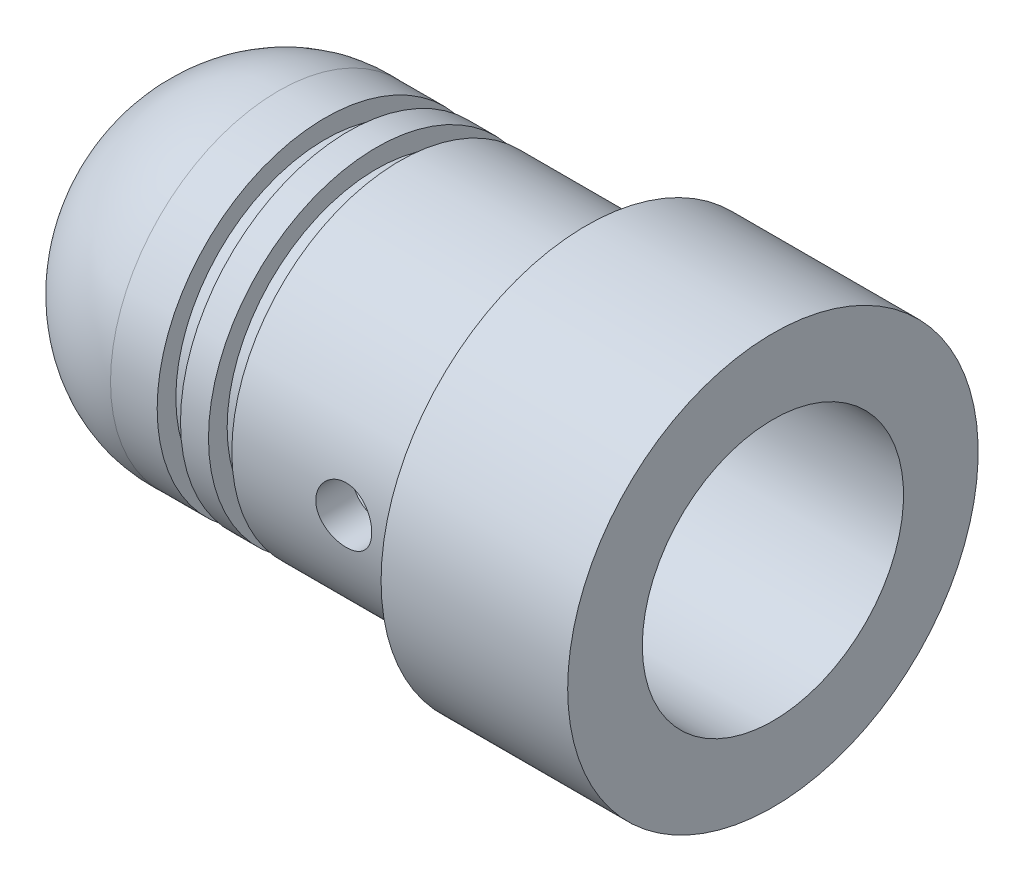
ISO-10303-21;
HEADER;
FILE_DESCRIPTION(('STEP AP214'),'2;1');
FILE_NAME('part.step','',(''),(''),'','','');
FILE_SCHEMA(('AUTOMOTIVE_DESIGN { 1 0 10303 214 1 1 1 1 }'));
ENDSEC;
DATA;
#1=APPLICATION_CONTEXT('core data for automotive mechanical design processes');
#2=APPLICATION_PROTOCOL_DEFINITION('international standard','automotive_design',2000,#1);
#3=PRODUCT_CONTEXT('',#1,'mechanical');
#4=PRODUCT('Part','Part','',(#3));
#5=PRODUCT_RELATED_PRODUCT_CATEGORY('part','',(#4));
#6=PRODUCT_DEFINITION_FORMATION('','',#4);
#7=PRODUCT_DEFINITION_CONTEXT('part definition',#1,'design');
#8=PRODUCT_DEFINITION('design','',#6,#7);
#9=PRODUCT_DEFINITION_SHAPE('','',#8);
#10=(LENGTH_UNIT() NAMED_UNIT(*) SI_UNIT(.MILLI.,.METRE.));
#11=(NAMED_UNIT(*) PLANE_ANGLE_UNIT() SI_UNIT($,.RADIAN.));
#12=(NAMED_UNIT(*) SI_UNIT($,.STERADIAN.) SOLID_ANGLE_UNIT());
#13=UNCERTAINTY_MEASURE_WITH_UNIT(LENGTH_MEASURE(1.E-05),#10,'distance_accuracy_value','');
#14=(GEOMETRIC_REPRESENTATION_CONTEXT(3) GLOBAL_UNCERTAINTY_ASSIGNED_CONTEXT((#13)) GLOBAL_UNIT_ASSIGNED_CONTEXT((#10,
#11,#12)) REPRESENTATION_CONTEXT('',''));
#15=CARTESIAN_POINT('',(0.,0.,0.));
#16=DIRECTION('',(0.,0.,1.));
#17=DIRECTION('',(1.,0.,0.));
#18=AXIS2_PLACEMENT_3D('',#15,#16,#17);
#19=CARTESIAN_POINT('',(-16.9151749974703,14.0000000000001,0.));
#20=DIRECTION('',(0.,0.,1.));
#21=DIRECTION('',(0.0554700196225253,0.998460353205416,0.));
#22=AXIS2_PLACEMENT_3D('',#19,#20,#21);
#23=ELLIPSE('',#22,9.01387818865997,7.99738020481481);
#24=TRIMMED_CURVE('',#23,(PARAMETER_VALUE(-1.52154564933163)),
(PARAMETER_VALUE(1.62004700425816)),.T.,.PARAMETER.);
#25=CARTESIAN_POINT('',(-99.9876483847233,14.,0.));
#26=DIRECTION('',(-1.,0.,0.));
#27=AXIS1_PLACEMENT('',#25,#26);
#28=SURFACE_OF_REVOLUTION('',#24,#27);
#29=CARTESIAN_POINT('',(-24.9151749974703,14.,0.));
#30=VERTEX_POINT('',#29);
#31=VERTEX_LOOP('',#30);
#32=FACE_BOUND('',#31,.T.);
#33=CARTESIAN_POINT('',(-16.4151749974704,14.0000000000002,0.));
#34=DIRECTION('',(-1.,0.,0.));
#35=DIRECTION('',(0.,0.,1.));
#36=AXIS2_PLACEMENT_3D('',#33,#34,#35);
#37=CIRCLE('',#36,9.);
#38=CARTESIAN_POINT('',(-16.4151749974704,14.0000000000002,9.));
#39=VERTEX_POINT('',#38);
#40=EDGE_CURVE('E373',#39,#39,#37,.T.);
#41=ORIENTED_EDGE('',*,*,#40,.T.);
#42=EDGE_LOOP('',(#41));
#43=FACE_BOUND('',#42,.T.);
#44=ADVANCED_FACE('F352',(#32,#43),#28,.T.);
#45=CARTESIAN_POINT('',(-14.9151749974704,21.,0.));
#46=DIRECTION('',(-1.,0.,0.));
#47=DIRECTION('',(0.,0.,1.));
#48=AXIS2_PLACEMENT_3D('',#45,#46,#47);
#49=PLANE('',#48);
#50=CARTESIAN_POINT('',(-14.9151749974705,14.0000000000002,0.));
#51=DIRECTION('',(-1.,0.,0.));
#52=DIRECTION('',(0.,0.,1.));
#53=AXIS2_PLACEMENT_3D('',#50,#51,#52);
#54=CIRCLE('',#53,7.);
#55=CARTESIAN_POINT('',(-14.9151749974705,14.0000000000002,7.));
#56=VERTEX_POINT('',#55);
#57=EDGE_CURVE('E11',#56,#56,#54,.T.);
#58=ORIENTED_EDGE('',*,*,#57,.F.);
#59=EDGE_LOOP('',(#58));
#60=FACE_BOUND('',#59,.T.);
#61=ADVANCED_FACE('F370',(#60),#49,.F.);
#62=CARTESIAN_POINT('',(-99.9876483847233,14.,0.));
#63=DIRECTION('',(-1.,0.,0.));
#64=DIRECTION('',(0.,0.,1.));
#65=AXIS2_PLACEMENT_3D('',#62,#63,#64);
#66=CYLINDRICAL_SURFACE('',#65,7.);
#67=CARTESIAN_POINT('',(-2.41517499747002,14.0000000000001,7.00000000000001));
#68=CARTESIAN_POINT('',(-2.4151778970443,14.0832358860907,6.99999846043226));
#69=CARTESIAN_POINT('',(-2.42212660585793,14.1665071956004,6.99850025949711));
#70=CARTESIAN_POINT('',(-2.44971065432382,14.3306873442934,6.99266829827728));
#71=CARTESIAN_POINT('',(-2.47035604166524,14.4115944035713,6.98833245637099));
#72=CARTESIAN_POINT('',(-2.52465936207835,14.5686493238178,6.97730831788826));
#73=CARTESIAN_POINT('',(-2.55830397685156,14.6448019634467,6.97062242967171));
#74=CARTESIAN_POINT('',(-2.63760908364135,14.7903781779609,6.9556210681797));
#75=CARTESIAN_POINT('',(-2.68326916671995,14.8598019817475,6.9473056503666));
#76=CARTESIAN_POINT('',(-2.78605529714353,14.9910247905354,6.92981369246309));
#77=CARTESIAN_POINT('',(-2.84333121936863,15.0527050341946,6.92062683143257));
#78=CARTESIAN_POINT('',(-2.96740131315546,15.1656604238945,6.90250069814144));
#79=CARTESIAN_POINT('',(-3.03419630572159,15.2169346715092,6.89356144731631));
#80=CARTESIAN_POINT('',(-3.17628075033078,15.3081420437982,6.87684116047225));
#81=CARTESIAN_POINT('',(-3.25165251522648,15.3479495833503,6.86907336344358));
#82=CARTESIAN_POINT('',(-3.40820945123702,15.4142882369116,6.85572325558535));
#83=CARTESIAN_POINT('',(-3.48939395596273,15.4408208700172,6.85014069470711));
#84=CARTESIAN_POINT('',(-3.65398608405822,15.4794657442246,6.84189808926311));
#85=CARTESIAN_POINT('',(-3.73734227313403,15.4917877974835,6.83919556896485));
#86=CARTESIAN_POINT('',(-3.90497922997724,15.5023139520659,6.83689139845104));
#87=CARTESIAN_POINT('',(-3.98925988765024,15.5005197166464,6.83728938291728));
#88=CARTESIAN_POINT('',(-4.15479968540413,15.4830332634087,6.84110276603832));
#89=CARTESIAN_POINT('',(-4.23608588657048,15.4675839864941,6.84446541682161));
#90=CARTESIAN_POINT('',(-4.39488523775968,15.4236105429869,6.85374593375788));
#91=CARTESIAN_POINT('',(-4.47239818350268,15.3950856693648,6.85966393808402));
#92=CARTESIAN_POINT('',(-4.62213787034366,15.32554551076,6.87344080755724));
#93=CARTESIAN_POINT('',(-4.69431951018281,15.2844361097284,6.88131420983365));
#94=CARTESIAN_POINT('',(-4.83085016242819,15.19096007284,6.89810572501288));
#95=CARTESIAN_POINT('',(-4.89519814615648,15.1385919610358,6.90702397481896));
#96=CARTESIAN_POINT('',(-5.01563435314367,15.0227954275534,6.92512718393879));
#97=CARTESIAN_POINT('',(-5.07152370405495,14.9591602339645,6.93431383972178));
#98=CARTESIAN_POINT('',(-5.17186873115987,14.8233173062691,6.95175017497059));
#99=CARTESIAN_POINT('',(-5.21632421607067,14.7511094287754,6.9599998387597));
#100=CARTESIAN_POINT('',(-5.2925856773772,14.59993346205,6.97465778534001));
#101=CARTESIAN_POINT('',(-5.32436641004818,14.5209522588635,6.98106238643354));
#102=CARTESIAN_POINT('',(-5.37415064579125,14.3586031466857,6.99128109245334));
#103=CARTESIAN_POINT('',(-5.39215607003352,14.2752358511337,6.99509555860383));
#104=CARTESIAN_POINT('',(-5.41359121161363,14.1081876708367,6.99965306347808));
#105=CARTESIAN_POINT('',(-5.41729271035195,14.0245431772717,7.00045336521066));
#106=CARTESIAN_POINT('',(-5.41075042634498,13.8578310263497,6.9990524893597));
#107=CARTESIAN_POINT('',(-5.40050754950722,13.7747633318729,6.99685150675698));
#108=CARTESIAN_POINT('',(-5.36659275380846,13.6124574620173,6.98973143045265));
#109=CARTESIAN_POINT('',(-5.34306262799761,13.5331882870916,6.9848410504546));
#110=CARTESIAN_POINT('',(-5.28339805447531,13.3797215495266,6.97288924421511));
#111=CARTESIAN_POINT('',(-5.24726256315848,13.3055244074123,6.96582763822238));
#112=CARTESIAN_POINT('',(-5.1628414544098,13.1631786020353,6.95017504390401));
#113=CARTESIAN_POINT('',(-5.11439520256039,13.0951274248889,6.94156431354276));
#114=CARTESIAN_POINT('',(-5.0069401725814,12.9680230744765,6.92381033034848));
#115=CARTESIAN_POINT('',(-4.94793008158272,12.9089710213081,6.91466701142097));
#116=CARTESIAN_POINT('',(-4.81977762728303,12.8004728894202,6.89668172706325));
#117=CARTESIAN_POINT('',(-4.75047489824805,12.7512146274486,6.88784792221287));
#118=CARTESIAN_POINT('',(-4.6044204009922,12.6650358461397,6.87166654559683));
#119=CARTESIAN_POINT('',(-4.52766895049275,12.628114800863,6.86431891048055));
#120=CARTESIAN_POINT('',(-4.36930269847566,12.5679025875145,6.85201009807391));
#121=CARTESIAN_POINT('',(-4.28771764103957,12.5445360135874,6.84703574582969));
#122=CARTESIAN_POINT('',(-4.12165941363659,12.5118730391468,6.8400118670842));
#123=CARTESIAN_POINT('',(-4.03718668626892,12.5025744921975,6.83796189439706));
#124=CARTESIAN_POINT('',(-3.869642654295,12.4984000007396,6.83704618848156));
#125=CARTESIAN_POINT('',(-3.78657898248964,12.503226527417,6.83811476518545));
#126=CARTESIAN_POINT('',(-3.62247775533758,12.5265021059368,6.84316763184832));
#127=CARTESIAN_POINT('',(-3.54144017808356,12.5449510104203,6.84715189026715));
#128=CARTESIAN_POINT('',(-3.38391633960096,12.5948065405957,6.85755581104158));
#129=CARTESIAN_POINT('',(-3.30741634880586,12.6261715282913,6.86396764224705));
#130=CARTESIAN_POINT('',(-3.16071962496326,12.7009324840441,6.87850764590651));
#131=CARTESIAN_POINT('',(-3.09052351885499,12.744329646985,6.88663598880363));
#132=CARTESIAN_POINT('',(-2.95695680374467,12.842917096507,6.90389055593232));
#133=CARTESIAN_POINT('',(-2.89374530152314,12.8983201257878,6.91303309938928));
#134=CARTESIAN_POINT('',(-2.77741873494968,13.0189134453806,6.93117449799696));
#135=CARTESIAN_POINT('',(-2.72430600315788,13.0841059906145,6.94017331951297));
#136=CARTESIAN_POINT('',(-2.62905903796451,13.2233968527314,6.95714491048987));
#137=CARTESIAN_POINT('',(-2.58706839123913,13.2975951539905,6.96510364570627));
#138=CARTESIAN_POINT('',(-2.51622046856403,13.4521498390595,6.97895826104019));
#139=CARTESIAN_POINT('',(-2.48735197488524,13.5325008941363,6.98485590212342));
#140=CARTESIAN_POINT('',(-2.44882281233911,13.6774647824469,6.99284848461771));
#141=CARTESIAN_POINT('',(-2.43622856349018,13.7412827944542,6.99551391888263));
#142=CARTESIAN_POINT('',(-2.41940369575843,13.8700600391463,6.9990902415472));
#143=CARTESIAN_POINT('',(-2.41517273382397,13.9350192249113,7.00000120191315));
#144=CARTESIAN_POINT('',(-2.41517499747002,14.0000000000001,7.00000000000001));
#145=B_SPLINE_CURVE_WITH_KNOTS('',3,(#67,#68,#69,#70,#71,#72,#73,#74,#75,#76,#77,#78,#79,#80,
#81,#82,#83,#84,#85,#86,#87,#88,#89,#90,#91,#92,#93,#94,#95,#96,#97,#98,#99,#100,#101,#102,#103,
#104,#105,#106,#107,#108,#109,#110,#111,#112,#113,#114,#115,#116,#117,#118,#119,#120,#121,#122,
#123,#124,#125,#126,#127,#128,#129,#130,#131,#132,#133,#134,#135,#136,#137,#138,#139,#140,#141,
#142,#143,#144),.UNSPECIFIED.,.T.,.F.,(4,2,2,2,2,2,2,2,2,2,2,2,2,2,2,2,2,2,2,2,2,2,2,2,2,2,2,2,
2,2,2,2,2,2,2,2,2,2,4),(0.,0.249469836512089,0.499122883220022,0.748520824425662,
0.997910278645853,1.25074961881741,1.50361077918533,1.75914429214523,2.01464855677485,
2.26633008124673,2.51798195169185,2.76524475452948,3.01252092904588,3.26169356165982,
3.51089887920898,3.76527011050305,4.01964559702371,4.27452521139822,4.52936927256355,
4.77934665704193,5.02930780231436,5.27665060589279,5.52401389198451,5.77478733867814,
6.02559197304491,6.2808206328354,6.53603841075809,6.78982240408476,7.04356767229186,
7.29200680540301,7.54044325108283,7.788084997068,8.03575134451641,8.28822950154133,
8.54076590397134,8.79641910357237,9.05185334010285,9.24661799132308,9.44137465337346),.UNSPECIFIED.);
#146=CARTESIAN_POINT('',(-2.41517499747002,14.0000000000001,7.00000000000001));
#147=VERTEX_POINT('',#146);
#148=EDGE_CURVE('E376',#147,#147,#145,.T.);
#149=ORIENTED_EDGE('',*,*,#148,.T.);
#150=EDGE_LOOP('',(#149));
#151=FACE_BOUND('',#150,.T.);
#152=CARTESIAN_POINT('',(-2.41517499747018,14.0000000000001,-7.));
#153=CARTESIAN_POINT('',(-2.41517789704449,13.9167641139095,-6.99999846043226));
#154=CARTESIAN_POINT('',(-2.42212660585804,13.8334928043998,-6.9985002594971));
#155=CARTESIAN_POINT('',(-2.44971065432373,13.6693126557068,-6.99266829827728));
#156=CARTESIAN_POINT('',(-2.47035604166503,13.5884055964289,-6.988332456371));
#157=CARTESIAN_POINT('',(-2.52465936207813,13.4313506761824,-6.97730831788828));
#158=CARTESIAN_POINT('',(-2.55830397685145,13.3551980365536,-6.97062242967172));
#159=CARTESIAN_POINT('',(-2.63760908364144,13.2096218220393,-6.95562106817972));
#160=CARTESIAN_POINT('',(-2.68326916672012,13.1401980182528,-6.94730565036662));
#161=CARTESIAN_POINT('',(-2.78605529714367,13.0089752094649,-6.92981369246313));
#162=CARTESIAN_POINT('',(-2.84333121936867,12.9472949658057,-6.92062683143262));
#163=CARTESIAN_POINT('',(-2.96740131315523,12.8343395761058,-6.90250069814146));
#164=CARTESIAN_POINT('',(-3.0341963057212,12.7830653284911,-6.89356144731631));
#165=CARTESIAN_POINT('',(-3.17628075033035,12.691857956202,-6.87684116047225));
#166=CARTESIAN_POINT('',(-3.25165251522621,12.6520504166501,-6.86907336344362));
#167=CARTESIAN_POINT('',(-3.40820945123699,12.5857117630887,-6.85572325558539));
#168=CARTESIAN_POINT('',(-3.4893939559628,12.5591791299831,-6.85014069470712));
#169=CARTESIAN_POINT('',(-3.6539860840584,12.5205342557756,-6.84189808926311));
#170=CARTESIAN_POINT('',(-3.7373422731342,12.5082122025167,-6.83919556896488));
#171=CARTESIAN_POINT('',(-3.90497922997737,12.4976860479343,-6.83689139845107));
#172=CARTESIAN_POINT('',(-3.98925988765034,12.4994802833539,-6.83728938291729));
#173=CARTESIAN_POINT('',(-4.15479968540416,12.5169667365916,-6.84110276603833));
#174=CARTESIAN_POINT('',(-4.23608588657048,12.5324160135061,-6.84446541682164));
#175=CARTESIAN_POINT('',(-4.39488523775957,12.5763894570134,-6.8537459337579));
#176=CARTESIAN_POINT('',(-4.47239818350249,12.6049143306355,-6.85966393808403));
#177=CARTESIAN_POINT('',(-4.62213787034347,12.6744544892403,-6.87344080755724));
#178=CARTESIAN_POINT('',(-4.6943195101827,12.7155638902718,-6.88131420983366));
#179=CARTESIAN_POINT('',(-4.83085016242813,12.8090399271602,-6.8981057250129));
#180=CARTESIAN_POINT('',(-4.89519814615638,12.8614080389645,-6.90702397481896));
#181=CARTESIAN_POINT('',(-5.01563435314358,12.977204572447,-6.92512718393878));
#182=CARTESIAN_POINT('',(-5.07152370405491,13.0408397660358,-6.9343138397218));
#183=CARTESIAN_POINT('',(-5.17186873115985,13.1766826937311,-6.95175017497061));
#184=CARTESIAN_POINT('',(-5.2163242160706,13.2488905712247,-6.95999983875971));
#185=CARTESIAN_POINT('',(-5.29258567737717,13.4000665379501,-6.97465778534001));
#186=CARTESIAN_POINT('',(-5.32436641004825,13.4790477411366,-6.98106238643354));
#187=CARTESIAN_POINT('',(-5.37415064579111,13.6413968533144,-6.99128109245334));
#188=CARTESIAN_POINT('',(-5.39215607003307,13.7247641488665,-6.99509555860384));
#189=CARTESIAN_POINT('',(-5.41359121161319,13.8918123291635,-6.99965306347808));
#190=CARTESIAN_POINT('',(-5.41729271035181,13.9754568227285,-7.00045336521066));
#191=CARTESIAN_POINT('',(-5.41075042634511,14.1421689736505,-6.99905248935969));
#192=CARTESIAN_POINT('',(-5.40050754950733,14.2252366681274,-6.99685150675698));
#193=CARTESIAN_POINT('',(-5.36659275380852,14.3875425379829,-6.98973143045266));
#194=CARTESIAN_POINT('',(-5.34306262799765,14.4668117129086,-6.98484105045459));
#195=CARTESIAN_POINT('',(-5.28339805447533,14.6202784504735,-6.9728892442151));
#196=CARTESIAN_POINT('',(-5.24726256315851,14.6944755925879,-6.96582763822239));
#197=CARTESIAN_POINT('',(-5.16284145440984,14.8368213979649,-6.95017504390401));
#198=CARTESIAN_POINT('',(-5.11439520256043,14.9048725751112,-6.94156431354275));
#199=CARTESIAN_POINT('',(-5.00694017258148,15.0319769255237,-6.92381033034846));
#200=CARTESIAN_POINT('',(-4.94793008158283,15.0910289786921,-6.91466701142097));
#201=CARTESIAN_POINT('',(-4.81977762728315,15.19952711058,-6.89668172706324));
#202=CARTESIAN_POINT('',(-4.75047489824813,15.2487853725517,-6.88784792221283));
#203=CARTESIAN_POINT('',(-4.60442040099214,15.3349641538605,-6.87166654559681));
#204=CARTESIAN_POINT('',(-4.52766895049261,15.3718851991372,-6.86431891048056));
#205=CARTESIAN_POINT('',(-4.36930269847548,15.4320974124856,-6.85201009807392));
#206=CARTESIAN_POINT('',(-4.28771764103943,15.4554639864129,-6.84703574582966));
#207=CARTESIAN_POINT('',(-4.12165941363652,15.4881269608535,-6.84001186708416));
#208=CARTESIAN_POINT('',(-4.03718668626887,15.4974255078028,-6.83796189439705));
#209=CARTESIAN_POINT('',(-3.869642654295,15.5015999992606,-6.83704618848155));
#210=CARTESIAN_POINT('',(-3.78657898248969,15.4967734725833,-6.83811476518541));
#211=CARTESIAN_POINT('',(-3.62247775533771,15.4734978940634,-6.84316763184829));
#212=CARTESIAN_POINT('',(-3.54144017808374,15.4550489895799,-6.84715189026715));
#213=CARTESIAN_POINT('',(-3.38391633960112,15.4051934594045,-6.85755581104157));
#214=CARTESIAN_POINT('',(-3.30741634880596,15.373828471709,-6.86396764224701));
#215=CARTESIAN_POINT('',(-3.16071962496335,15.2990675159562,-6.87850764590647));
#216=CARTESIAN_POINT('',(-3.09052351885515,15.2556703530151,-6.88663598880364));
#217=CARTESIAN_POINT('',(-2.95695680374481,15.1570829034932,-6.90389055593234));
#218=CARTESIAN_POINT('',(-2.89374530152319,15.1016798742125,-6.91303309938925));
#219=CARTESIAN_POINT('',(-2.77741873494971,14.9810865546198,-6.93117449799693));
#220=CARTESIAN_POINT('',(-2.72430600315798,14.9158940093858,-6.94017331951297));
#221=CARTESIAN_POINT('',(-2.62905903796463,14.7766031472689,-6.95714491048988));
#222=CARTESIAN_POINT('',(-2.58706839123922,14.7024048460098,-6.96510364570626));
#223=CARTESIAN_POINT('',(-2.51622046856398,14.5478501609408,-6.97895826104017));
#224=CARTESIAN_POINT('',(-2.48735197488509,14.4674991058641,-6.98485590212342));
#225=CARTESIAN_POINT('',(-2.44882281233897,14.3225352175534,-6.99284848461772));
#226=CARTESIAN_POINT('',(-2.43622856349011,14.2587172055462,-6.99551391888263));
#227=CARTESIAN_POINT('',(-2.41940369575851,14.129939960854,-6.99909024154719));
#228=CARTESIAN_POINT('',(-2.41517273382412,14.0649807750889,-7.00000120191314));
#229=CARTESIAN_POINT('',(-2.41517499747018,14.0000000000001,-7.));
#230=B_SPLINE_CURVE_WITH_KNOTS('',3,(#152,#153,#154,#155,#156,#157,#158,#159,#160,#161,#162,
#163,#164,#165,#166,#167,#168,#169,#170,#171,#172,#173,#174,#175,#176,#177,#178,#179,#180,#181,
#182,#183,#184,#185,#186,#187,#188,#189,#190,#191,#192,#193,#194,#195,#196,#197,#198,#199,#200,
#201,#202,#203,#204,#205,#206,#207,#208,#209,#210,#211,#212,#213,#214,#215,#216,#217,#218,#219,
#220,#221,#222,#223,#224,#225,#226,#227,#228,#229),.UNSPECIFIED.,.T.,.F.,(4,2,2,2,2,2,2,2,2,2,2,
2,2,2,2,2,2,2,2,2,2,2,2,2,2,2,2,2,2,2,2,2,2,2,2,2,2,2,4),(0.,0.249469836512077,0.4991228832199,
0.748520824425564,0.997910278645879,1.25074961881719,1.50361077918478,1.75914429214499,
2.01464855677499,2.26633008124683,2.51798195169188,2.76524475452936,3.01252092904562,
3.26169356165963,3.51089887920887,3.76527011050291,4.01964559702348,4.27452521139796,
4.52936927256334,4.77934665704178,5.02930780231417,5.27665060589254,5.52401389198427,
5.7747873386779,6.02559197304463,6.28082063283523,6.53603841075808,6.7898224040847,
7.04356767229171,7.29200680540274,7.54044325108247,7.78808499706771,8.03575134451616,
8.28822950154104,8.54076590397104,8.7964191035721,9.05185334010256,9.24661799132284,
9.44137465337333),.UNSPECIFIED.);
#231=CARTESIAN_POINT('',(-2.41517499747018,14.0000000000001,-7.));
#232=VERTEX_POINT('',#231);
#233=EDGE_CURVE('E382',#232,#232,#230,.T.);
#234=ORIENTED_EDGE('',*,*,#233,.T.);
#235=EDGE_LOOP('',(#234));
#236=FACE_BOUND('',#235,.T.);
#237=CARTESIAN_POINT('',(10.0848250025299,14.0000000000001,0.));
#238=DIRECTION('',(-1.,0.,0.));
#239=DIRECTION('',(0.,0.,1.));
#240=AXIS2_PLACEMENT_3D('',#237,#238,#239);
#241=CIRCLE('',#240,7.);
#242=CARTESIAN_POINT('',(10.0848250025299,14.0000000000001,7.00000000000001));
#243=VERTEX_POINT('',#242);
#244=EDGE_CURVE('E364',#243,#243,#241,.T.);
#245=ORIENTED_EDGE('',*,*,#244,.F.);
#246=EDGE_LOOP('',(#245));
#247=FACE_BOUND('',#246,.T.);
#248=ORIENTED_EDGE('',*,*,#57,.T.);
#249=EDGE_LOOP('',(#248));
#250=FACE_BOUND('',#249,.T.);
#251=ADVANCED_FACE('F442',(#151,#236,#247,#250),#66,.F.);
#252=CARTESIAN_POINT('',(10.0848250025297,25.,0.));
#253=DIRECTION('',(-1.,0.,0.));
#254=DIRECTION('',(0.,0.,1.));
#255=AXIS2_PLACEMENT_3D('',#252,#253,#254);
#256=PLANE('',#255);
#257=CARTESIAN_POINT('',(10.0848250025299,14.0000000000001,0.));
#258=DIRECTION('',(-1.,0.,0.));
#259=DIRECTION('',(0.,0.,1.));
#260=AXIS2_PLACEMENT_3D('',#257,#258,#259);
#261=CIRCLE('',#260,11.);
#262=CARTESIAN_POINT('',(10.0848250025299,14.0000000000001,11.));
#263=VERTEX_POINT('',#262);
#264=EDGE_CURVE('E412',#263,#263,#261,.T.);
#265=ORIENTED_EDGE('',*,*,#264,.F.);
#266=EDGE_LOOP('',(#265));
#267=FACE_BOUND('',#266,.T.);
#268=ORIENTED_EDGE('',*,*,#244,.T.);
#269=EDGE_LOOP('',(#268));
#270=FACE_BOUND('',#269,.T.);
#271=ADVANCED_FACE('F446',(#267,#270),#256,.F.);
#272=CARTESIAN_POINT('',(-99.9876483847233,14.,0.));
#273=DIRECTION('',(-1.,0.,0.));
#274=DIRECTION('',(0.,0.,1.));
#275=AXIS2_PLACEMENT_3D('',#272,#273,#274);
#276=CYLINDRICAL_SURFACE('',#275,11.);
#277=CARTESIAN_POINT('',(0.0848250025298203,14.0000000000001,0.));
#278=DIRECTION('',(-1.,0.,0.));
#279=DIRECTION('',(0.,0.,1.));
#280=AXIS2_PLACEMENT_3D('',#277,#278,#279);
#281=CIRCLE('',#280,11.);
#282=CARTESIAN_POINT('',(0.0848250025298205,14.0000000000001,11.));
#283=VERTEX_POINT('',#282);
#284=EDGE_CURVE('E409',#283,#283,#281,.T.);
#285=ORIENTED_EDGE('',*,*,#284,.F.);
#286=EDGE_LOOP('',(#285));
#287=FACE_BOUND('',#286,.T.);
#288=ORIENTED_EDGE('',*,*,#264,.T.);
#289=EDGE_LOOP('',(#288));
#290=FACE_BOUND('',#289,.T.);
#291=ADVANCED_FACE('F469',(#287,#290),#276,.T.);
#292=CARTESIAN_POINT('',(0.084825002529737,23.0000000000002,0.));
#293=DIRECTION('',(1.,0.,0.));
#294=DIRECTION('',(0.,0.,-1.));
#295=AXIS2_PLACEMENT_3D('',#292,#293,#294);
#296=PLANE('',#295);
#297=CARTESIAN_POINT('',(0.0848250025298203,14.0000000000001,0.));
#298=DIRECTION('',(-1.,0.,0.));
#299=DIRECTION('',(0.,0.,1.));
#300=AXIS2_PLACEMENT_3D('',#297,#298,#299);
#301=CIRCLE('',#300,9.);
#302=CARTESIAN_POINT('',(0.0848250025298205,14.0000000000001,9.));
#303=VERTEX_POINT('',#302);
#304=EDGE_CURVE('E406',#303,#303,#301,.T.);
#305=ORIENTED_EDGE('',*,*,#304,.F.);
#306=EDGE_LOOP('',(#305));
#307=FACE_BOUND('',#306,.T.);
#308=ORIENTED_EDGE('',*,*,#284,.T.);
#309=EDGE_LOOP('',(#308));
#310=FACE_BOUND('',#309,.T.);
#311=ADVANCED_FACE('F476',(#307,#310),#296,.F.);
#312=CARTESIAN_POINT('',(-99.9876483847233,14.,0.));
#313=DIRECTION('',(-1.,0.,0.));
#314=DIRECTION('',(0.,0.,1.));
#315=AXIS2_PLACEMENT_3D('',#312,#313,#314);
#316=CYLINDRICAL_SURFACE('',#315,9.);
#317=CARTESIAN_POINT('',(-2.41517499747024,14.0000000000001,8.99999999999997));
#318=CARTESIAN_POINT('',(-2.41517835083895,13.9163654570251,8.99999856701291));
#319=CARTESIAN_POINT('',(-2.42219336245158,13.8326852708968,8.9988220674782));
#320=CARTESIAN_POINT('',(-2.45005639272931,13.6676718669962,8.99424206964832));
#321=CARTESIAN_POINT('',(-2.470917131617,13.5863408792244,8.99083652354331));
#322=CARTESIAN_POINT('',(-2.52582426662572,13.4284371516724,8.98218040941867));
#323=CARTESIAN_POINT('',(-2.55985987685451,13.3518605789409,8.97693135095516));
#324=CARTESIAN_POINT('',(-2.64012237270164,13.2055148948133,8.96516536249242));
#325=CARTESIAN_POINT('',(-2.68634786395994,13.1357450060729,8.95864857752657));
#326=CARTESIAN_POINT('',(-2.79014804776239,13.0043164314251,8.94499990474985));
#327=CARTESIAN_POINT('',(-2.84781646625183,12.9427322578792,8.93786323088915));
#328=CARTESIAN_POINT('',(-2.97266377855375,12.8300669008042,8.92381576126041));
#329=CARTESIAN_POINT('',(-3.0398432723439,12.7789863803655,8.91690497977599));
#330=CARTESIAN_POINT('',(-3.18231757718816,12.688479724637,8.90404539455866));
#331=CARTESIAN_POINT('',(-3.25765979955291,12.6491272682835,8.89810277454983));
#332=CARTESIAN_POINT('',(-3.41400073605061,12.5836649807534,8.88791873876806));
#333=CARTESIAN_POINT('',(-3.49499906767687,12.5575542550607,8.88367720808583));
#334=CARTESIAN_POINT('',(-3.65956316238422,12.5195513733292,8.87742322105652));
#335=CARTESIAN_POINT('',(-3.74309843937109,12.5075305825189,8.87539061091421));
#336=CARTESIAN_POINT('',(-3.91102316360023,12.4976499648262,8.87372363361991));
#337=CARTESIAN_POINT('',(-3.99541254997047,12.4997891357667,8.87408909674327));
#338=CARTESIAN_POINT('',(-4.16173171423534,12.5180629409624,8.87715857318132));
#339=CARTESIAN_POINT('',(-4.24367787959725,12.5340530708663,8.87983843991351));
#340=CARTESIAN_POINT('',(-4.40370778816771,12.5793481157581,8.88719697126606));
#341=CARTESIAN_POINT('',(-4.48179139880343,12.6086534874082,8.89187570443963));
#342=CARTESIAN_POINT('',(-4.63231229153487,12.6798936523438,8.9027308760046));
#343=CARTESIAN_POINT('',(-4.704720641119,12.7218884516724,8.90891440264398));
#344=CARTESIAN_POINT('',(-4.84151763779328,12.8172727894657,8.92207751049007));
#345=CARTESIAN_POINT('',(-4.90590563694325,12.8706632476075,8.92905715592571));
#346=CARTESIAN_POINT('',(-5.02567064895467,12.9881106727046,8.94313216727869));
#347=CARTESIAN_POINT('',(-5.08092610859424,13.0522916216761,8.9502278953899));
#348=CARTESIAN_POINT('',(-5.17990165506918,13.1890788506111,8.96365560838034));
#349=CARTESIAN_POINT('',(-5.22362166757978,13.2616851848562,8.96998758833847));
#350=CARTESIAN_POINT('',(-5.29829633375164,13.4133764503,8.98118335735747));
#351=CARTESIAN_POINT('',(-5.32924024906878,13.4924667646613,8.98604591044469));
#352=CARTESIAN_POINT('',(-5.37737152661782,13.6548209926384,8.99374501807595));
#353=CARTESIAN_POINT('',(-5.3945600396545,13.7380845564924,8.99658174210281));
#354=CARTESIAN_POINT('',(-5.41452781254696,13.9053740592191,8.99988677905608));
#355=CARTESIAN_POINT('',(-5.4174739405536,13.9893795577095,9.0003825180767));
#356=CARTESIAN_POINT('',(-5.4093181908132,14.156683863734,8.99902484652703));
#357=CARTESIAN_POINT('',(-5.39821685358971,14.2399826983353,8.99717152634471));
#358=CARTESIAN_POINT('',(-5.36242008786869,14.4029937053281,8.99134096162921));
#359=CARTESIAN_POINT('',(-5.33780727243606,14.4827245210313,8.98737662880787));
#360=CARTESIAN_POINT('',(-5.27577428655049,14.6369281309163,8.97776678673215));
#361=CARTESIAN_POINT('',(-5.23835339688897,14.7114006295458,8.9721211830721));
#362=CARTESIAN_POINT('',(-5.15138432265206,14.8536984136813,8.95970709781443));
#363=CARTESIAN_POINT('',(-5.10173190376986,14.9214591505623,8.95292913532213));
#364=CARTESIAN_POINT('',(-4.99185260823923,15.0477461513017,8.93903080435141));
#365=CARTESIAN_POINT('',(-4.93162496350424,15.106271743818,8.93191041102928));
#366=CARTESIAN_POINT('',(-4.80155646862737,15.2130456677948,8.91804105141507));
#367=CARTESIAN_POINT('',(-4.73162249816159,15.2611812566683,8.91129669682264));
#368=CARTESIAN_POINT('',(-4.58456321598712,15.3450213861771,8.8990291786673));
#369=CARTESIAN_POINT('',(-4.50743813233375,15.380726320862,8.8935059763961));
#370=CARTESIAN_POINT('',(-4.34850115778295,15.438522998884,8.88434072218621));
#371=CARTESIAN_POINT('',(-4.26671014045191,15.4606708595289,8.88069092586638));
#372=CARTESIAN_POINT('',(-4.10050291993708,15.4909012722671,8.87566630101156));
#373=CARTESIAN_POINT('',(-4.01608694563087,15.4989850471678,8.87429127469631));
#374=CARTESIAN_POINT('',(-3.84815189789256,15.5008237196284,8.87398039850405));
#375=CARTESIAN_POINT('',(-3.76463477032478,15.4947560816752,8.87501433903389));
#376=CARTESIAN_POINT('',(-3.5998274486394,15.4688479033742,8.87933868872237));
#377=CARTESIAN_POINT('',(-3.51853724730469,15.4490074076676,8.88262909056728));
#378=CARTESIAN_POINT('',(-3.36055993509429,15.396184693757,8.89108413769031));
#379=CARTESIAN_POINT('',(-3.28386759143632,15.3632177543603,8.89624660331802));
#380=CARTESIAN_POINT('',(-3.13707359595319,15.2850962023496,8.90786621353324));
#381=CARTESIAN_POINT('',(-3.06697227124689,15.2399409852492,8.91432342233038));
#382=CARTESIAN_POINT('',(-2.93445364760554,15.1380913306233,8.92790072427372));
#383=CARTESIAN_POINT('',(-2.87213738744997,15.0812663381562,8.93502777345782));
#384=CARTESIAN_POINT('',(-2.75786403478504,14.9579654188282,8.94908623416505));
#385=CARTESIAN_POINT('',(-2.70590933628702,14.8914872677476,8.95601760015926));
#386=CARTESIAN_POINT('',(-2.61350603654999,14.7502215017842,8.96895917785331));
#387=CARTESIAN_POINT('',(-2.57313937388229,14.6753796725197,8.97496269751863));
#388=CARTESIAN_POINT('',(-2.50561330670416,14.5199078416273,8.98530700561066));
#389=CARTESIAN_POINT('',(-2.47844074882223,14.439283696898,8.98964944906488));
#390=CARTESIAN_POINT('',(-2.44397183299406,14.2986219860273,8.99523474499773));
#391=CARTESIAN_POINT('',(-2.43319031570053,14.2394352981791,8.99701216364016));
#392=CARTESIAN_POINT('',(-2.41879075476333,14.1201735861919,8.99939529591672));
#393=CARTESIAN_POINT('',(-2.41517258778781,14.0600985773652,9.00000102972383));
#394=CARTESIAN_POINT('',(-2.41517499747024,14.0000000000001,8.99999999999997));
#395=B_SPLINE_CURVE_WITH_KNOTS('',3,(#317,#318,#319,#320,#321,#322,#323,#324,#325,#326,#327,
#328,#329,#330,#331,#332,#333,#334,#335,#336,#337,#338,#339,#340,#341,#342,#343,#344,#345,#346,
#347,#348,#349,#350,#351,#352,#353,#354,#355,#356,#357,#358,#359,#360,#361,#362,#363,#364,#365,
#366,#367,#368,#369,#370,#371,#372,#373,#374,#375,#376,#377,#378,#379,#380,#381,#382,#383,#384,
#385,#386,#387,#388,#389,#390,#391,#392,#393,#394),.UNSPECIFIED.,.T.,.F.,(4,2,2,2,2,2,2,2,2,2,2,
2,2,2,2,2,2,2,2,2,2,2,2,2,2,2,2,2,2,2,2,2,2,2,2,2,2,2,4),(0.,0.250683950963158,
0.501598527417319,0.752308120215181,1.00298904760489,1.25581494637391,1.50865680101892,
1.76305512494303,2.01743626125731,2.2694764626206,2.5214988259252,2.77092313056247,
3.02035599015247,3.2709873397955,3.52163892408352,3.77539661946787,4.0291559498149,
4.28312813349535,4.53707906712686,4.78804730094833,5.03900587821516,5.28844684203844,
5.53790181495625,5.78956095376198,6.04123837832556,6.29552293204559,6.54979942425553,
6.80301613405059,7.05621082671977,7.30624745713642,7.55628327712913,7.80602890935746,
8.05578693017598,8.30850830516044,8.56128800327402,8.81581338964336,9.07008451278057,
9.25022548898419,9.43036336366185),.UNSPECIFIED.);
#396=CARTESIAN_POINT('',(-2.41517499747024,14.0000000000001,8.99999999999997));
#397=VERTEX_POINT('',#396);
#398=EDGE_CURVE('E356',#397,#397,#395,.T.);
#399=ORIENTED_EDGE('',*,*,#398,.T.);
#400=EDGE_LOOP('',(#399));
#401=FACE_BOUND('',#400,.T.);
#402=CARTESIAN_POINT('',(-2.41517499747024,14.0000000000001,-9.00000000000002));
#403=CARTESIAN_POINT('',(-2.41517835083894,14.0836345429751,-8.99999856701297));
#404=CARTESIAN_POINT('',(-2.42219336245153,14.1673147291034,-8.9988220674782));
#405=CARTESIAN_POINT('',(-2.45005639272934,14.332328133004,-8.99424206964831));
#406=CARTESIAN_POINT('',(-2.47091713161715,14.4136591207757,-8.99083652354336));
#407=CARTESIAN_POINT('',(-2.52582426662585,14.5715628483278,-8.98218040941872));
#408=CARTESIAN_POINT('',(-2.55985987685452,14.6481394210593,-8.97693135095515));
#409=CARTESIAN_POINT('',(-2.64012237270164,14.794485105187,-8.9651653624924));
#410=CARTESIAN_POINT('',(-2.68634786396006,14.8642549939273,-8.9586485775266));
#411=CARTESIAN_POINT('',(-2.79014804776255,14.9956835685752,-8.94499990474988));
#412=CARTESIAN_POINT('',(-2.84781646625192,15.0572677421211,-8.93786323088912));
#413=CARTESIAN_POINT('',(-2.97266377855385,15.1699330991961,-8.92381576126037));
#414=CARTESIAN_POINT('',(-3.03984327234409,15.2210136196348,-8.916904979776));
#415=CARTESIAN_POINT('',(-3.18231757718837,15.3115202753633,-8.90404539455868));
#416=CARTESIAN_POINT('',(-3.25765979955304,15.3508727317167,-8.8981027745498));
#417=CARTESIAN_POINT('',(-3.41400073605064,15.4163350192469,-8.88791873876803));
#418=CARTESIAN_POINT('',(-3.49499906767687,15.4424457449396,-8.88367720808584));
#419=CARTESIAN_POINT('',(-3.65956316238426,15.4804486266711,-8.87742322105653));
#420=CARTESIAN_POINT('',(-3.74309843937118,15.4924694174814,-8.87539061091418));
#421=CARTESIAN_POINT('',(-3.91102316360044,15.5023500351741,-8.87372363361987));
#422=CARTESIAN_POINT('',(-3.99541254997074,15.5002108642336,-8.87408909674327));
#423=CARTESIAN_POINT('',(-4.16173171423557,15.4819370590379,-8.87715857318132));
#424=CARTESIAN_POINT('',(-4.24367787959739,15.465946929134,-8.87983843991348));
#425=CARTESIAN_POINT('',(-4.40370778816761,15.4206518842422,-8.88719697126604));
#426=CARTESIAN_POINT('',(-4.4817913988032,15.3913465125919,-8.89187570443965));
#427=CARTESIAN_POINT('',(-4.63231229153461,15.3201063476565,-8.90273087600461));
#428=CARTESIAN_POINT('',(-4.70472064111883,15.278111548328,-8.90891440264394));
#429=CARTESIAN_POINT('',(-4.8415176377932,15.1827272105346,-8.92207751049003));
#430=CARTESIAN_POINT('',(-4.90590563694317,15.1293367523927,-8.92905715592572));
#431=CARTESIAN_POINT('',(-5.02567064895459,15.0118893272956,-8.94313216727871));
#432=CARTESIAN_POINT('',(-5.08092610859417,14.947708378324,-8.95022789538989));
#433=CARTESIAN_POINT('',(-5.1799016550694,14.8109211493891,-8.96365560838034));
#434=CARTESIAN_POINT('',(-5.22362166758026,14.7383148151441,-8.9699875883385));
#435=CARTESIAN_POINT('',(-5.29829633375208,14.5866235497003,-8.9811833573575));
#436=CARTESIAN_POINT('',(-5.32924024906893,14.507533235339,-8.98604591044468));
#437=CARTESIAN_POINT('',(-5.37737152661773,14.3451790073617,-8.99374501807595));
#438=CARTESIAN_POINT('',(-5.39456003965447,14.2619154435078,-8.99658174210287));
#439=CARTESIAN_POINT('',(-5.41452781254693,14.094625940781,-8.99988677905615));
#440=CARTESIAN_POINT('',(-5.41747394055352,14.0106204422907,-9.00038251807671));
#441=CARTESIAN_POINT('',(-5.40931819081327,13.8433161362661,-8.99902484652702));
#442=CARTESIAN_POINT('',(-5.39821685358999,13.7600173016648,-8.99717152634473));
#443=CARTESIAN_POINT('',(-5.36242008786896,13.597006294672,-8.99134096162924));
#444=CARTESIAN_POINT('',(-5.3378072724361,13.5172754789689,-8.98737662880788));
#445=CARTESIAN_POINT('',(-5.27577428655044,13.3630718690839,-8.97776678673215));
#446=CARTESIAN_POINT('',(-5.23835339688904,13.2885993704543,-8.97212118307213));
#447=CARTESIAN_POINT('',(-5.15138432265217,13.1463015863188,-8.95970709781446));
#448=CARTESIAN_POINT('',(-5.10173190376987,13.0785408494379,-8.95292913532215));
#449=CARTESIAN_POINT('',(-4.99185260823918,12.9522538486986,-8.93903080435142));
#450=CARTESIAN_POINT('',(-4.93162496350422,12.8937282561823,-8.93191041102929));
#451=CARTESIAN_POINT('',(-4.80155646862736,12.7869543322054,-8.91804105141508));
#452=CARTESIAN_POINT('',(-4.73162249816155,12.7388187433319,-8.91129669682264));
#453=CARTESIAN_POINT('',(-4.58456321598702,12.6549786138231,-8.89902917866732));
#454=CARTESIAN_POINT('',(-4.5074381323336,12.6192736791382,-8.89350597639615));
#455=CARTESIAN_POINT('',(-4.34850115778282,12.5614770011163,-8.88434072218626));
#456=CARTESIAN_POINT('',(-4.26671014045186,12.5393291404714,-8.8806909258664));
#457=CARTESIAN_POINT('',(-4.10050291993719,12.5090987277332,-8.87566630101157));
#458=CARTESIAN_POINT('',(-4.01608694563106,12.5010149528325,-8.87429127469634));
#459=CARTESIAN_POINT('',(-3.84815189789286,12.4991762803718,-8.87398039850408));
#460=CARTESIAN_POINT('',(-3.7646347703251,12.505243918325,-8.87501433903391));
#461=CARTESIAN_POINT('',(-3.59982744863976,12.531152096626,-8.87933868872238));
#462=CARTESIAN_POINT('',(-3.51853724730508,12.5509925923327,-8.8826290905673));
#463=CARTESIAN_POINT('',(-3.36055993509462,12.6038153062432,-8.89108413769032));
#464=CARTESIAN_POINT('',(-3.28386759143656,12.6367822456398,-8.89624660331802));
#465=CARTESIAN_POINT('',(-3.13707359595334,12.7149037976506,-8.90786621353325));
#466=CARTESIAN_POINT('',(-3.06697227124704,12.760059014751,-8.91432342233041));
#467=CARTESIAN_POINT('',(-2.93445364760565,12.8619086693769,-8.92790072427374));
#468=CARTESIAN_POINT('',(-2.87213738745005,12.9187336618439,-8.93502777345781));
#469=CARTESIAN_POINT('',(-2.75786403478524,13.0420345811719,-8.94908623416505));
#470=CARTESIAN_POINT('',(-2.70590933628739,13.1085127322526,-8.95601760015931));
#471=CARTESIAN_POINT('',(-2.61350603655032,13.2497784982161,-8.96895917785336));
#472=CARTESIAN_POINT('',(-2.57313937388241,13.3246203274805,-8.97496269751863));
#473=CARTESIAN_POINT('',(-2.50561330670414,13.4800921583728,-8.98530700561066));
#474=CARTESIAN_POINT('',(-2.47844074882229,13.5607163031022,-8.98964944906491));
#475=CARTESIAN_POINT('',(-2.44397183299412,13.7013780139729,-8.99523474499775));
#476=CARTESIAN_POINT('',(-2.43319031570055,13.7605647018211,-8.99701216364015));
#477=CARTESIAN_POINT('',(-2.41879075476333,13.8798264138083,-8.99939529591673));
#478=CARTESIAN_POINT('',(-2.41517258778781,13.939901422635,-9.00000102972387));
#479=CARTESIAN_POINT('',(-2.41517499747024,14.0000000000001,-9.00000000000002));
#480=B_SPLINE_CURVE_WITH_KNOTS('',3,(#402,#403,#404,#405,#406,#407,#408,#409,#410,#411,#412,
#413,#414,#415,#416,#417,#418,#419,#420,#421,#422,#423,#424,#425,#426,#427,#428,#429,#430,#431,
#432,#433,#434,#435,#436,#437,#438,#439,#440,#441,#442,#443,#444,#445,#446,#447,#448,#449,#450,
#451,#452,#453,#454,#455,#456,#457,#458,#459,#460,#461,#462,#463,#464,#465,#466,#467,#468,#469,
#470,#471,#472,#473,#474,#475,#476,#477,#478,#479),.UNSPECIFIED.,.T.,.F.,(4,2,2,2,2,2,2,2,2,2,2,
2,2,2,2,2,2,2,2,2,2,2,2,2,2,2,2,2,2,2,2,2,2,2,2,2,2,2,4),(0.,0.250683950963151,
0.501598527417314,0.752308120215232,1.00298904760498,1.25581494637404,1.50865680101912,
1.76305512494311,2.01743626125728,2.26947646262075,2.52149882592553,2.77092313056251,
3.0203559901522,3.27098733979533,3.52163892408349,3.77539661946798,4.02915594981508,
4.28312813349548,4.53707906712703,4.78804730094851,5.03900587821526,5.28844684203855,
5.53790181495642,5.78956095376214,6.04123837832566,6.29552293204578,6.54979942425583,
6.80301613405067,7.0562108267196,7.30624745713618,7.55628327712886,7.80602890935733,
8.05578693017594,8.30850830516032,8.56128800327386,8.81581338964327,9.07008451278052,
9.25022548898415,9.43036336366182),.UNSPECIFIED.);
#481=CARTESIAN_POINT('',(-2.41517499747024,14.0000000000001,-9.00000000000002));
#482=VERTEX_POINT('',#481);
#483=EDGE_CURVE('E416',#482,#482,#480,.T.);
#484=ORIENTED_EDGE('',*,*,#483,.T.);
#485=EDGE_LOOP('',(#484));
#486=FACE_BOUND('',#485,.T.);
#487=CARTESIAN_POINT('',(-9.91517499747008,14.,0.));
#488=DIRECTION('',(-1.,0.,0.));
#489=DIRECTION('',(0.,0.,1.));
#490=AXIS2_PLACEMENT_3D('',#487,#488,#489);
#491=CIRCLE('',#490,9.);
#492=CARTESIAN_POINT('',(-9.91517499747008,14.,9.));
#493=VERTEX_POINT('',#492);
#494=EDGE_CURVE('E403',#493,#493,#491,.T.);
#495=ORIENTED_EDGE('',*,*,#494,.F.);
#496=EDGE_LOOP('',(#495));
#497=FACE_BOUND('',#496,.T.);
#498=ORIENTED_EDGE('',*,*,#304,.T.);
#499=EDGE_LOOP('',(#498));
#500=FACE_BOUND('',#499,.T.);
#501=ADVANCED_FACE('F420',(#401,#486,#497,#500),#316,.T.);
#502=CARTESIAN_POINT('',(-9.9151749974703,22.0000000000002,0.));
#503=DIRECTION('',(1.,0.,0.));
#504=DIRECTION('',(0.,0.,-1.));
#505=AXIS2_PLACEMENT_3D('',#502,#503,#504);
#506=PLANE('',#505);
#507=CARTESIAN_POINT('',(-9.91517499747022,14.0000000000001,0.));
#508=DIRECTION('',(-1.,0.,0.));
#509=DIRECTION('',(0.,0.,1.));
#510=AXIS2_PLACEMENT_3D('',#507,#508,#509);
#511=CIRCLE('',#510,8.);
#512=CARTESIAN_POINT('',(-9.91517499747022,14.0000000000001,8.));
#513=VERTEX_POINT('',#512);
#514=EDGE_CURVE('E400',#513,#513,#511,.T.);
#515=ORIENTED_EDGE('',*,*,#514,.F.);
#516=EDGE_LOOP('',(#515));
#517=FACE_BOUND('',#516,.T.);
#518=ORIENTED_EDGE('',*,*,#494,.T.);
#519=EDGE_LOOP('',(#518));
#520=FACE_BOUND('',#519,.T.);
#521=ADVANCED_FACE('F489',(#517,#520),#506,.F.);
#522=CARTESIAN_POINT('',(-99.9876483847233,14.,0.));
#523=DIRECTION('',(-1.,0.,0.));
#524=DIRECTION('',(0.,0.,1.));
#525=AXIS2_PLACEMENT_3D('',#522,#523,#524);
#526=CYLINDRICAL_SURFACE('',#525,8.);
#527=CARTESIAN_POINT('',(-11.1651749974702,14.0000000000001,0.));
#528=DIRECTION('',(-1.,0.,0.));
#529=DIRECTION('',(0.,0.,1.));
#530=AXIS2_PLACEMENT_3D('',#527,#528,#529);
#531=CIRCLE('',#530,8.);
#532=CARTESIAN_POINT('',(-11.1651749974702,14.0000000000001,8.));
#533=VERTEX_POINT('',#532);
#534=EDGE_CURVE('E397',#533,#533,#531,.T.);
#535=ORIENTED_EDGE('',*,*,#534,.F.);
#536=EDGE_LOOP('',(#535));
#537=FACE_BOUND('',#536,.T.);
#538=ORIENTED_EDGE('',*,*,#514,.T.);
#539=EDGE_LOOP('',(#538));
#540=FACE_BOUND('',#539,.T.);
#541=ADVANCED_FACE('F496',(#537,#540),#526,.T.);
#542=CARTESIAN_POINT('',(-11.1651749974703,23.,0.));
#543=DIRECTION('',(-1.,0.,0.));
#544=DIRECTION('',(0.,0.,1.));
#545=AXIS2_PLACEMENT_3D('',#542,#543,#544);
#546=PLANE('',#545);
#547=CARTESIAN_POINT('',(-11.1651749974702,14.0000000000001,0.));
#548=DIRECTION('',(-1.,0.,0.));
#549=DIRECTION('',(0.,0.,1.));
#550=AXIS2_PLACEMENT_3D('',#547,#548,#549);
#551=CIRCLE('',#550,9.);
#552=CARTESIAN_POINT('',(-11.1651749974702,14.0000000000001,9.));
#553=VERTEX_POINT('',#552);
#554=EDGE_CURVE('E394',#553,#553,#551,.T.);
#555=ORIENTED_EDGE('',*,*,#554,.F.);
#556=EDGE_LOOP('',(#555));
#557=FACE_BOUND('',#556,.T.);
#558=ORIENTED_EDGE('',*,*,#534,.T.);
#559=EDGE_LOOP('',(#558));
#560=FACE_BOUND('',#559,.T.);
#561=ADVANCED_FACE('F503',(#557,#560),#546,.F.);
#562=CARTESIAN_POINT('',(-99.9876483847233,14.,0.));
#563=DIRECTION('',(-1.,0.,0.));
#564=DIRECTION('',(0.,0.,1.));
#565=AXIS2_PLACEMENT_3D('',#562,#563,#564);
#566=CYLINDRICAL_SURFACE('',#565,9.);
#567=CARTESIAN_POINT('',(-12.6651749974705,14.0000000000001,0.));
#568=DIRECTION('',(-1.,0.,0.));
#569=DIRECTION('',(0.,0.,1.));
#570=AXIS2_PLACEMENT_3D('',#567,#568,#569);
#571=CIRCLE('',#570,9.);
#572=CARTESIAN_POINT('',(-12.6651749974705,14.0000000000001,9.));
#573=VERTEX_POINT('',#572);
#574=EDGE_CURVE('E391',#573,#573,#571,.T.);
#575=ORIENTED_EDGE('',*,*,#574,.F.);
#576=EDGE_LOOP('',(#575));
#577=FACE_BOUND('',#576,.T.);
#578=ORIENTED_EDGE('',*,*,#554,.T.);
#579=EDGE_LOOP('',(#578));
#580=FACE_BOUND('',#579,.T.);
#581=ADVANCED_FACE('F511',(#577,#580),#566,.T.);
#582=CARTESIAN_POINT('',(-12.6651749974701,22.0000000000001,0.));
#583=DIRECTION('',(1.,0.,0.));
#584=DIRECTION('',(0.,0.,-1.));
#585=AXIS2_PLACEMENT_3D('',#582,#583,#584);
#586=PLANE('',#585);
#587=CARTESIAN_POINT('',(-12.6651749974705,14.0000000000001,0.));
#588=DIRECTION('',(-1.,0.,0.));
#589=DIRECTION('',(0.,0.,1.));
#590=AXIS2_PLACEMENT_3D('',#587,#588,#589);
#591=CIRCLE('',#590,8.);
#592=CARTESIAN_POINT('',(-12.6651749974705,14.0000000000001,8.));
#593=VERTEX_POINT('',#592);
#594=EDGE_CURVE('E388',#593,#593,#591,.T.);
#595=ORIENTED_EDGE('',*,*,#594,.F.);
#596=EDGE_LOOP('',(#595));
#597=FACE_BOUND('',#596,.T.);
#598=ORIENTED_EDGE('',*,*,#574,.T.);
#599=EDGE_LOOP('',(#598));
#600=FACE_BOUND('',#599,.T.);
#601=ADVANCED_FACE('F519',(#597,#600),#586,.F.);
#602=CARTESIAN_POINT('',(-99.9876483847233,14.,0.));
#603=DIRECTION('',(-1.,0.,0.));
#604=DIRECTION('',(0.,0.,1.));
#605=AXIS2_PLACEMENT_3D('',#602,#603,#604);
#606=CYLINDRICAL_SURFACE('',#605,8.);
#607=CARTESIAN_POINT('',(-13.9151749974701,14.,0.));
#608=DIRECTION('',(-1.,0.,0.));
#609=DIRECTION('',(0.,0.,1.));
#610=AXIS2_PLACEMENT_3D('',#607,#608,#609);
#611=CIRCLE('',#610,8.);
#612=CARTESIAN_POINT('',(-13.9151749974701,14.,8.));
#613=VERTEX_POINT('',#612);
#614=EDGE_CURVE('E379',#613,#613,#611,.T.);
#615=ORIENTED_EDGE('',*,*,#614,.F.);
#616=EDGE_LOOP('',(#615));
#617=FACE_BOUND('',#616,.T.);
#618=ORIENTED_EDGE('',*,*,#594,.T.);
#619=EDGE_LOOP('',(#618));
#620=FACE_BOUND('',#619,.T.);
#621=ADVANCED_FACE('F527',(#617,#620),#606,.T.);
#622=CARTESIAN_POINT('',(-13.9151749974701,23.0000000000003,0.));
#623=DIRECTION('',(-1.,0.,0.));
#624=DIRECTION('',(0.,0.,1.));
#625=AXIS2_PLACEMENT_3D('',#622,#623,#624);
#626=PLANE('',#625);
#627=CARTESIAN_POINT('',(-13.9151749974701,14.,0.));
#628=DIRECTION('',(-1.,0.,0.));
#629=DIRECTION('',(0.,0.,1.));
#630=AXIS2_PLACEMENT_3D('',#627,#628,#629);
#631=CIRCLE('',#630,9.);
#632=CARTESIAN_POINT('',(-13.9151749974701,14.,9.));
#633=VERTEX_POINT('',#632);
#634=EDGE_CURVE('E375',#633,#633,#631,.T.);
#635=ORIENTED_EDGE('',*,*,#634,.F.);
#636=EDGE_LOOP('',(#635));
#637=FACE_BOUND('',#636,.T.);
#638=ORIENTED_EDGE('',*,*,#614,.T.);
#639=EDGE_LOOP('',(#638));
#640=FACE_BOUND('',#639,.T.);
#641=ADVANCED_FACE('F535',(#637,#640),#626,.F.);
#642=CARTESIAN_POINT('',(-99.9876483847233,14.,0.));
#643=DIRECTION('',(-1.,0.,0.));
#644=DIRECTION('',(0.,0.,1.));
#645=AXIS2_PLACEMENT_3D('',#642,#643,#644);
#646=CYLINDRICAL_SURFACE('',#645,9.);
#647=ORIENTED_EDGE('',*,*,#40,.F.);
#648=EDGE_LOOP('',(#647));
#649=FACE_BOUND('',#648,.T.);
#650=ORIENTED_EDGE('',*,*,#634,.T.);
#651=EDGE_LOOP('',(#650));
#652=FACE_BOUND('',#651,.T.);
#653=ADVANCED_FACE('F430',(#649,#652),#646,.T.);
#654=CARTESIAN_POINT('',(-3.91517499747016,14.0000000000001,-11.));
#655=DIRECTION('',(0.,0.,1.));
#656=DIRECTION('',(1.,0.,0.));
#657=AXIS2_PLACEMENT_3D('',#654,#655,#656);
#658=CYLINDRICAL_SURFACE('',#657,1.5);
#659=ORIENTED_EDGE('',*,*,#483,.F.);
#660=EDGE_LOOP('',(#659));
#661=FACE_BOUND('',#660,.T.);
#662=ORIENTED_EDGE('',*,*,#233,.F.);
#663=EDGE_LOOP('',(#662));
#664=FACE_BOUND('',#663,.T.);
#665=ADVANCED_FACE('F428',(#661,#664),#658,.F.);
#666=ORIENTED_EDGE('',*,*,#398,.F.);
#667=EDGE_LOOP('',(#666));
#668=FACE_BOUND('',#667,.T.);
#669=ORIENTED_EDGE('',*,*,#148,.F.);
#670=EDGE_LOOP('',(#669));
#671=FACE_BOUND('',#670,.T.);
#672=ADVANCED_FACE('F424',(#668,#671),#658,.F.);
#673=CLOSED_SHELL('',(#44,#61,#251,#271,#291,#311,#501,#521,#541,#561,#581,#601,#621,#641,#653,
#665,#672));
#674=MANIFOLD_SOLID_BREP('B2',#673);
#675=ADVANCED_BREP_SHAPE_REPRESENTATION('',(#18,#674),#14);
#676=SHAPE_DEFINITION_REPRESENTATION(#9,#675);
ENDSEC;
END-ISO-10303-21;
